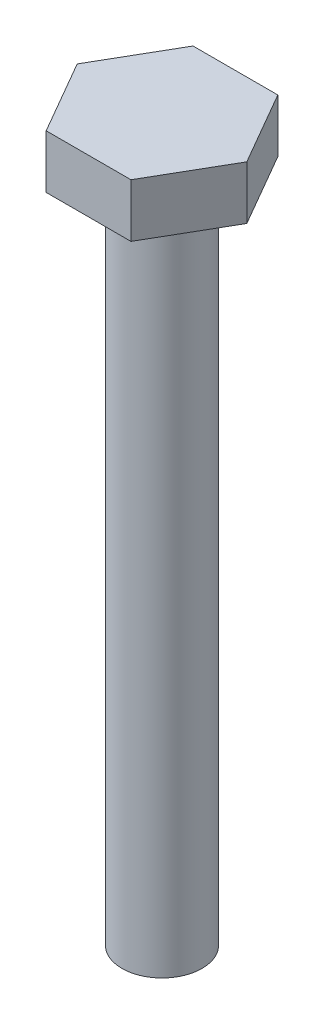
from build123d import *

# Parameters (mm, degrees)
BOSS_EXTRU_1_DEPTH = 2
ESQUISSE2_R        = 1.5
BOSS_EXTRU_2_DEPTH = 25


with BuildPart() as part:
    # Esquisse1 → Boss.-Extru.1 (new body)
    with BuildSketch(Plane(origin=(0, 0, 0), x_dir=(1, 0, 0), z_dir=(0, 1, 0))):
        Polygon((3.175426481, 0), (1.58771324, 2.75), (-1.58771324, 2.75), (-3.175426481, 0), (-1.58771324, -2.75), (1.58771324, -2.75), align=None)
    extrude(amount=BOSS_EXTRU_1_DEPTH)

    # Esquisse2 → Boss.-Extru.2 (add)
    with BuildSketch(Plane.XZ):
        with Locations(Location((0, 0, 0), (0, 0, 90))):
            Circle(ESQUISSE2_R)
    extrude(amount=BOSS_EXTRU_2_DEPTH)


solid = part.part
